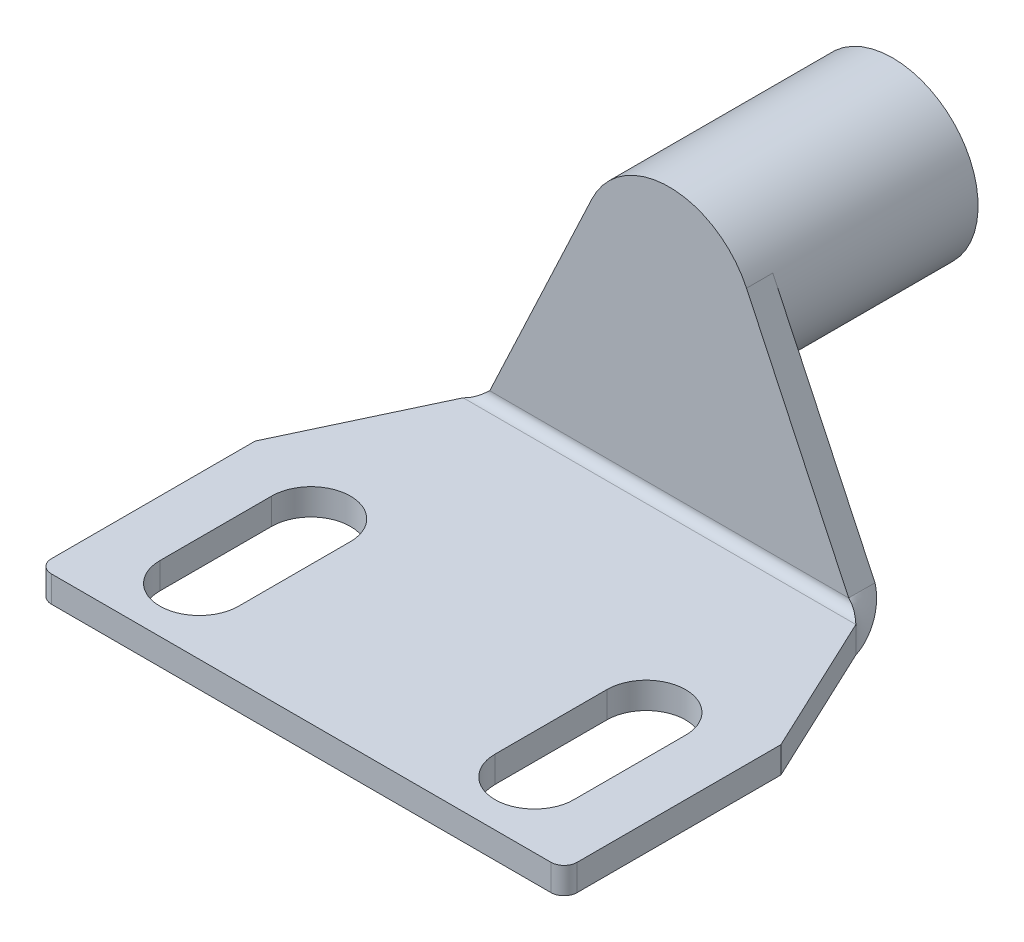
ISO-10303-21;
HEADER;
FILE_DESCRIPTION(('STEP AP214'),'2;1');
FILE_NAME('part.step','',(''),(''),'','','');
FILE_SCHEMA(('AUTOMOTIVE_DESIGN { 1 0 10303 214 1 1 1 1 }'));
ENDSEC;
DATA;
#1=APPLICATION_CONTEXT('core data for automotive mechanical design processes');
#2=APPLICATION_PROTOCOL_DEFINITION('international standard','automotive_design',2000,#1);
#3=PRODUCT_CONTEXT('',#1,'mechanical');
#4=PRODUCT('Part','Part','',(#3));
#5=PRODUCT_RELATED_PRODUCT_CATEGORY('part','',(#4));
#6=PRODUCT_DEFINITION_FORMATION('','',#4);
#7=PRODUCT_DEFINITION_CONTEXT('part definition',#1,'design');
#8=PRODUCT_DEFINITION('design','',#6,#7);
#9=PRODUCT_DEFINITION_SHAPE('','',#8);
#10=(LENGTH_UNIT() NAMED_UNIT(*) SI_UNIT(.MILLI.,.METRE.));
#11=(NAMED_UNIT(*) PLANE_ANGLE_UNIT() SI_UNIT($,.RADIAN.));
#12=(NAMED_UNIT(*) SI_UNIT($,.STERADIAN.) SOLID_ANGLE_UNIT());
#13=UNCERTAINTY_MEASURE_WITH_UNIT(LENGTH_MEASURE(1.E-05),#10,'distance_accuracy_value','');
#14=(GEOMETRIC_REPRESENTATION_CONTEXT(3) GLOBAL_UNCERTAINTY_ASSIGNED_CONTEXT((#13)) GLOBAL_UNIT_ASSIGNED_CONTEXT((#10,
#11,#12)) REPRESENTATION_CONTEXT('',''));
#15=CARTESIAN_POINT('',(0.,0.,0.));
#16=DIRECTION('',(0.,0.,1.));
#17=DIRECTION('',(1.,0.,0.));
#18=AXIS2_PLACEMENT_3D('',#15,#16,#17);
#19=CARTESIAN_POINT('',(-20.,-2.,0.));
#20=DIRECTION('',(-1.,0.,0.));
#21=DIRECTION('',(0.,0.,1.));
#22=AXIS2_PLACEMENT_3D('',#19,#20,#21);
#23=PLANE('',#22);
#24=DIRECTION('',(0.,0.,1.));
#25=VECTOR('',#24,1.);
#26=CARTESIAN_POINT('',(-20.,-2.,0.));
#27=LINE('',#26,#25);
#28=CARTESIAN_POINT('',(-20.,-2.,-18.5));
#29=VERTEX_POINT('',#28);
#30=CARTESIAN_POINT('',(-20.,-2.,-3.));
#31=VERTEX_POINT('',#30);
#32=EDGE_CURVE('E426',#29,#31,#27,.T.);
#33=ORIENTED_EDGE('',*,*,#32,.T.);
#34=DIRECTION('',(0.,1.,0.));
#35=VECTOR('',#34,1.);
#36=CARTESIAN_POINT('',(-20.,-2.,-3.));
#37=LINE('',#36,#35);
#38=CARTESIAN_POINT('',(-20.,0.,-3.));
#39=VERTEX_POINT('',#38);
#40=EDGE_CURVE('E552',#31,#39,#37,.T.);
#41=ORIENTED_EDGE('',*,*,#40,.T.);
#42=DIRECTION('',(0.,0.,1.));
#43=VECTOR('',#42,1.);
#44=CARTESIAN_POINT('',(-20.,0.,0.));
#45=LINE('',#44,#43);
#46=CARTESIAN_POINT('',(-20.,0.,-18.5));
#47=VERTEX_POINT('',#46);
#48=EDGE_CURVE('E416',#47,#39,#45,.T.);
#49=ORIENTED_EDGE('',*,*,#48,.F.);
#50=DIRECTION('',(0.,1.,0.));
#51=VECTOR('',#50,1.);
#52=CARTESIAN_POINT('',(-20.,-2.,-18.5));
#53=LINE('',#52,#51);
#54=EDGE_CURVE('E404',#29,#47,#53,.T.);
#55=ORIENTED_EDGE('',*,*,#54,.F.);
#56=EDGE_LOOP('',(#33,#41,#49,#55));
#57=FACE_BOUND('',#56,.T.);
#58=ADVANCED_FACE('F69',(#57),#23,.T.);
#59=CARTESIAN_POINT('',(20.,-2.,0.));
#60=DIRECTION('',(1.,0.,0.));
#61=DIRECTION('',(0.,0.,-1.));
#62=AXIS2_PLACEMENT_3D('',#59,#60,#61);
#63=PLANE('',#62);
#64=DIRECTION('',(0.,0.,-1.));
#65=VECTOR('',#64,1.);
#66=CARTESIAN_POINT('',(20.,0.,0.));
#67=LINE('',#66,#65);
#68=CARTESIAN_POINT('',(20.,0.,-3.));
#69=VERTEX_POINT('',#68);
#70=CARTESIAN_POINT('',(20.,0.,-18.5));
#71=VERTEX_POINT('',#70);
#72=EDGE_CURVE('E414',#69,#71,#67,.T.);
#73=ORIENTED_EDGE('',*,*,#72,.F.);
#74=DIRECTION('',(0.,-1.,0.));
#75=VECTOR('',#74,1.);
#76=CARTESIAN_POINT('',(20.,-2.,-3.));
#77=LINE('',#76,#75);
#78=CARTESIAN_POINT('',(20.,-2.,-3.));
#79=VERTEX_POINT('',#78);
#80=EDGE_CURVE('E12',#69,#79,#77,.T.);
#81=ORIENTED_EDGE('',*,*,#80,.T.);
#82=DIRECTION('',(0.,0.,-1.));
#83=VECTOR('',#82,1.);
#84=CARTESIAN_POINT('',(20.,-2.,0.));
#85=LINE('',#84,#83);
#86=CARTESIAN_POINT('',(20.,-2.,-18.5));
#87=VERTEX_POINT('',#86);
#88=EDGE_CURVE('E424',#79,#87,#85,.T.);
#89=ORIENTED_EDGE('',*,*,#88,.T.);
#90=DIRECTION('',(0.,1.,0.));
#91=VECTOR('',#90,1.);
#92=CARTESIAN_POINT('',(20.,-2.,-18.5));
#93=LINE('',#92,#91);
#94=EDGE_CURVE('E420',#87,#71,#93,.T.);
#95=ORIENTED_EDGE('',*,*,#94,.T.);
#96=EDGE_LOOP('',(#73,#81,#89,#95));
#97=FACE_BOUND('',#96,.T.);
#98=ADVANCED_FACE('F578',(#97),#63,.T.);
#99=CARTESIAN_POINT('',(0.,-2.,-45.75));
#100=DIRECTION('',(0.,1.,0.));
#101=DIRECTION('',(0.,0.,1.));
#102=AXIS2_PLACEMENT_3D('',#99,#100,#101);
#103=PLANE('',#102);
#104=DIRECTION('',(0.,0.,1.));
#105=VECTOR('',#104,1.);
#106=CARTESIAN_POINT('',(-15.75,-2.,-45.75));
#107=LINE('',#106,#105);
#108=CARTESIAN_POINT('',(-15.75,-2.,-15.5));
#109=VERTEX_POINT('',#108);
#110=CARTESIAN_POINT('',(-15.75,-2.,-7.));
#111=VERTEX_POINT('',#110);
#112=EDGE_CURVE('E268',#109,#111,#107,.T.);
#113=ORIENTED_EDGE('',*,*,#112,.T.);
#114=CARTESIAN_POINT('',(-12.75,-2.,-7.));
#115=DIRECTION('',(0.,1.,0.));
#116=DIRECTION('',(0.,0.,1.));
#117=AXIS2_PLACEMENT_3D('',#114,#115,#116);
#118=CIRCLE('',#117,3.);
#119=CARTESIAN_POINT('',(-9.75,-2.,-7.));
#120=VERTEX_POINT('',#119);
#121=EDGE_CURVE('E271',#111,#120,#118,.T.);
#122=ORIENTED_EDGE('',*,*,#121,.T.);
#123=DIRECTION('',(0.,0.,-1.));
#124=VECTOR('',#123,1.);
#125=CARTESIAN_POINT('',(-9.74999999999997,-2.,-45.75));
#126=LINE('',#125,#124);
#127=CARTESIAN_POINT('',(-9.74999999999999,-2.,-15.5));
#128=VERTEX_POINT('',#127);
#129=EDGE_CURVE('E239',#120,#128,#126,.T.);
#130=ORIENTED_EDGE('',*,*,#129,.T.);
#131=CARTESIAN_POINT('',(-12.75,-2.,-15.5));
#132=DIRECTION('',(0.,1.,0.));
#133=DIRECTION('',(0.,0.,1.));
#134=AXIS2_PLACEMENT_3D('',#131,#132,#133);
#135=CIRCLE('',#134,3.);
#136=EDGE_CURVE('E265',#128,#109,#135,.T.);
#137=ORIENTED_EDGE('',*,*,#136,.T.);
#138=EDGE_LOOP('',(#113,#122,#130,#137));
#139=FACE_BOUND('',#138,.T.);
#140=DIRECTION('',(0.,0.,1.));
#141=VECTOR('',#140,1.);
#142=CARTESIAN_POINT('',(9.74999999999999,-2.,-45.75));
#143=LINE('',#142,#141);
#144=CARTESIAN_POINT('',(9.75,-2.,-15.5));
#145=VERTEX_POINT('',#144);
#146=CARTESIAN_POINT('',(9.75,-2.,-7.));
#147=VERTEX_POINT('',#146);
#148=EDGE_CURVE('E277',#145,#147,#143,.T.);
#149=ORIENTED_EDGE('',*,*,#148,.T.);
#150=CARTESIAN_POINT('',(12.75,-2.,-7.));
#151=DIRECTION('',(0.,1.,0.));
#152=DIRECTION('',(0.,0.,1.));
#153=AXIS2_PLACEMENT_3D('',#150,#151,#152);
#154=CIRCLE('',#153,3.);
#155=CARTESIAN_POINT('',(15.75,-2.,-7.));
#156=VERTEX_POINT('',#155);
#157=EDGE_CURVE('E280',#147,#156,#154,.T.);
#158=ORIENTED_EDGE('',*,*,#157,.T.);
#159=DIRECTION('',(0.,0.,-1.));
#160=VECTOR('',#159,1.);
#161=CARTESIAN_POINT('',(15.75,-2.,-45.75));
#162=LINE('',#161,#160);
#163=CARTESIAN_POINT('',(15.75,-2.,-15.5));
#164=VERTEX_POINT('',#163);
#165=EDGE_CURVE('E274',#156,#164,#162,.T.);
#166=ORIENTED_EDGE('',*,*,#165,.T.);
#167=CARTESIAN_POINT('',(12.75,-2.,-15.5));
#168=DIRECTION('',(0.,1.,0.));
#169=DIRECTION('',(0.,0.,1.));
#170=AXIS2_PLACEMENT_3D('',#167,#168,#169);
#171=CIRCLE('',#170,3.);
#172=EDGE_CURVE('E214',#164,#145,#171,.T.);
#173=ORIENTED_EDGE('',*,*,#172,.T.);
#174=EDGE_LOOP('',(#149,#158,#166,#173));
#175=FACE_BOUND('',#174,.T.);
#176=DIRECTION('',(1.,0.,0.));
#177=VECTOR('',#176,1.);
#178=CARTESIAN_POINT('',(0.,-2.,-2.));
#179=LINE('',#178,#177);
#180=CARTESIAN_POINT('',(-19.,-2.,-2.));
#181=VERTEX_POINT('',#180);
#182=CARTESIAN_POINT('',(19.,-2.,-2.));
#183=VERTEX_POINT('',#182);
#184=EDGE_CURVE('E245',#181,#183,#179,.T.);
#185=ORIENTED_EDGE('',*,*,#184,.F.);
#186=CARTESIAN_POINT('',(-19.,-2.,-3.));
#187=DIRECTION('',(0.,1.,0.));
#188=DIRECTION('',(0.,0.,1.));
#189=AXIS2_PLACEMENT_3D('',#186,#187,#188);
#190=CIRCLE('',#189,1.);
#191=EDGE_CURVE('E77',#181,#31,#190,.F.);
#192=ORIENTED_EDGE('',*,*,#191,.T.);
#193=ORIENTED_EDGE('',*,*,#32,.F.);
#194=DIRECTION('',(-0.42561713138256,0.,0.904903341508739));
#195=VECTOR('',#194,1.);
#196=CARTESIAN_POINT('',(-20.,-2.,-18.5));
#197=LINE('',#196,#195);
#198=CARTESIAN_POINT('',(-14.9374842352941,-2.,-29.2634));
#199=VERTEX_POINT('',#198);
#200=EDGE_CURVE('E413',#199,#29,#197,.T.);
#201=ORIENTED_EDGE('',*,*,#200,.F.);
#202=DIRECTION('',(-1.,0.,0.));
#203=VECTOR('',#202,1.);
#204=CARTESIAN_POINT('',(0.,-2.,-29.2634));
#205=LINE('',#204,#203);
#206=CARTESIAN_POINT('',(14.9374842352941,-2.,-29.2634));
#207=VERTEX_POINT('',#206);
#208=EDGE_CURVE('E429',#207,#199,#205,.T.);
#209=ORIENTED_EDGE('',*,*,#208,.F.);
#210=DIRECTION('',(-0.42561713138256,0.,-0.904903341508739));
#211=VECTOR('',#210,1.);
#212=CARTESIAN_POINT('',(20.,-2.,-18.5));
#213=LINE('',#212,#211);
#214=EDGE_CURVE('E423',#87,#207,#213,.T.);
#215=ORIENTED_EDGE('',*,*,#214,.F.);
#216=ORIENTED_EDGE('',*,*,#88,.F.);
#217=CARTESIAN_POINT('',(19.,-2.,-3.));
#218=DIRECTION('',(0.,1.,0.));
#219=DIRECTION('',(0.,0.,1.));
#220=AXIS2_PLACEMENT_3D('',#217,#218,#219);
#221=CIRCLE('',#220,1.);
#222=EDGE_CURVE('E84',#79,#183,#221,.F.);
#223=ORIENTED_EDGE('',*,*,#222,.T.);
#224=EDGE_LOOP('',(#185,#192,#193,#201,#209,#215,#216,#223));
#225=FACE_BOUND('',#224,.T.);
#226=ADVANCED_FACE('F463',(#139,#175,#225),#103,.F.);
#227=CARTESIAN_POINT('',(0.,0.,-45.75));
#228=DIRECTION('',(0.,1.,0.));
#229=DIRECTION('',(0.,0.,1.));
#230=AXIS2_PLACEMENT_3D('',#227,#228,#229);
#231=PLANE('',#230);
#232=CARTESIAN_POINT('',(12.75,0.,-7.));
#233=DIRECTION('',(0.,1.,0.));
#234=DIRECTION('',(0.,0.,1.));
#235=AXIS2_PLACEMENT_3D('',#232,#233,#234);
#236=CIRCLE('',#235,3.);
#237=CARTESIAN_POINT('',(9.75,0.,-7.));
#238=VERTEX_POINT('',#237);
#239=CARTESIAN_POINT('',(15.75,0.,-7.));
#240=VERTEX_POINT('',#239);
#241=EDGE_CURVE('E227',#238,#240,#236,.T.);
#242=ORIENTED_EDGE('',*,*,#241,.F.);
#243=DIRECTION('',(0.,0.,1.));
#244=VECTOR('',#243,1.);
#245=CARTESIAN_POINT('',(9.75,0.,-7.));
#246=LINE('',#245,#244);
#247=CARTESIAN_POINT('',(9.75,0.,-15.5));
#248=VERTEX_POINT('',#247);
#249=EDGE_CURVE('E232',#248,#238,#246,.T.);
#250=ORIENTED_EDGE('',*,*,#249,.F.);
#251=CARTESIAN_POINT('',(12.75,0.,-15.5));
#252=DIRECTION('',(0.,1.,0.));
#253=DIRECTION('',(0.,0.,1.));
#254=AXIS2_PLACEMENT_3D('',#251,#252,#253);
#255=CIRCLE('',#254,3.);
#256=CARTESIAN_POINT('',(15.75,0.,-15.5));
#257=VERTEX_POINT('',#256);
#258=EDGE_CURVE('E211',#257,#248,#255,.T.);
#259=ORIENTED_EDGE('',*,*,#258,.F.);
#260=DIRECTION('',(0.,0.,-1.));
#261=VECTOR('',#260,1.);
#262=CARTESIAN_POINT('',(15.75,0.,-7.));
#263=LINE('',#262,#261);
#264=EDGE_CURVE('E222',#240,#257,#263,.T.);
#265=ORIENTED_EDGE('',*,*,#264,.F.);
#266=EDGE_LOOP('',(#242,#250,#259,#265));
#267=FACE_BOUND('',#266,.T.);
#268=CARTESIAN_POINT('',(-12.75,0.,-7.));
#269=DIRECTION('',(0.,1.,0.));
#270=DIRECTION('',(0.,0.,-1.));
#271=AXIS2_PLACEMENT_3D('',#268,#269,#270);
#272=CIRCLE('',#271,3.);
#273=CARTESIAN_POINT('',(-15.75,0.,-7.));
#274=VERTEX_POINT('',#273);
#275=CARTESIAN_POINT('',(-9.75,0.,-7.00000000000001));
#276=VERTEX_POINT('',#275);
#277=EDGE_CURVE('E242',#274,#276,#272,.T.);
#278=ORIENTED_EDGE('',*,*,#277,.F.);
#279=DIRECTION('',(0.,0.,1.));
#280=VECTOR('',#279,1.);
#281=CARTESIAN_POINT('',(-15.75,0.,-7.));
#282=LINE('',#281,#280);
#283=CARTESIAN_POINT('',(-15.75,0.,-15.5));
#284=VERTEX_POINT('',#283);
#285=EDGE_CURVE('E251',#284,#274,#282,.T.);
#286=ORIENTED_EDGE('',*,*,#285,.F.);
#287=CARTESIAN_POINT('',(-12.75,0.,-15.5));
#288=DIRECTION('',(0.,1.,0.));
#289=DIRECTION('',(0.,0.,-1.));
#290=AXIS2_PLACEMENT_3D('',#287,#288,#289);
#291=CIRCLE('',#290,3.);
#292=CARTESIAN_POINT('',(-9.74999999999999,0.,-15.5));
#293=VERTEX_POINT('',#292);
#294=EDGE_CURVE('E248',#293,#284,#291,.T.);
#295=ORIENTED_EDGE('',*,*,#294,.F.);
#296=DIRECTION('',(0.,0.,-1.));
#297=VECTOR('',#296,1.);
#298=CARTESIAN_POINT('',(-9.75,0.,-7.));
#299=LINE('',#298,#297);
#300=EDGE_CURVE('E244',#276,#293,#299,.T.);
#301=ORIENTED_EDGE('',*,*,#300,.F.);
#302=EDGE_LOOP('',(#278,#286,#295,#301));
#303=FACE_BOUND('',#302,.T.);
#304=ORIENTED_EDGE('',*,*,#48,.T.);
#305=CARTESIAN_POINT('',(-19.,0.,-3.));
#306=DIRECTION('',(0.,1.,0.));
#307=DIRECTION('',(0.,0.,1.));
#308=AXIS2_PLACEMENT_3D('',#305,#306,#307);
#309=CIRCLE('',#308,1.);
#310=CARTESIAN_POINT('',(-19.,0.,-2.));
#311=VERTEX_POINT('',#310);
#312=EDGE_CURVE('E557',#39,#311,#309,.T.);
#313=ORIENTED_EDGE('',*,*,#312,.T.);
#314=DIRECTION('',(1.,0.,0.));
#315=VECTOR('',#314,1.);
#316=CARTESIAN_POINT('',(0.,0.,-2.));
#317=LINE('',#316,#315);
#318=CARTESIAN_POINT('',(19.,0.,-2.));
#319=VERTEX_POINT('',#318);
#320=EDGE_CURVE('E290',#311,#319,#317,.T.);
#321=ORIENTED_EDGE('',*,*,#320,.T.);
#322=CARTESIAN_POINT('',(19.,0.,-3.));
#323=DIRECTION('',(0.,1.,0.));
#324=DIRECTION('',(0.,0.,1.));
#325=AXIS2_PLACEMENT_3D('',#322,#323,#324);
#326=CIRCLE('',#325,1.);
#327=EDGE_CURVE('E555',#319,#69,#326,.T.);
#328=ORIENTED_EDGE('',*,*,#327,.T.);
#329=ORIENTED_EDGE('',*,*,#72,.T.);
#330=DIRECTION('',(-0.42561713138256,0.,-0.904903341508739));
#331=VECTOR('',#330,1.);
#332=CARTESIAN_POINT('',(20.,0.,-18.5));
#333=LINE('',#332,#331);
#334=CARTESIAN_POINT('',(14.9374842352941,0.,-29.2634));
#335=VERTEX_POINT('',#334);
#336=EDGE_CURVE('E433',#71,#335,#333,.T.);
#337=ORIENTED_EDGE('',*,*,#336,.T.);
#338=DIRECTION('',(-1.,0.,0.));
#339=VECTOR('',#338,1.);
#340=CARTESIAN_POINT('',(0.,0.,-29.2634));
#341=LINE('',#340,#339);
#342=CARTESIAN_POINT('',(-14.9374842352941,0.,-29.2634));
#343=VERTEX_POINT('',#342);
#344=EDGE_CURVE('E430',#335,#343,#341,.T.);
#345=ORIENTED_EDGE('',*,*,#344,.T.);
#346=DIRECTION('',(-0.42561713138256,0.,0.904903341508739));
#347=VECTOR('',#346,1.);
#348=CARTESIAN_POINT('',(-20.,0.,-18.5));
#349=LINE('',#348,#347);
#350=EDGE_CURVE('E419',#343,#47,#349,.T.);
#351=ORIENTED_EDGE('',*,*,#350,.T.);
#352=EDGE_LOOP('',(#304,#313,#321,#328,#329,#337,#345,#351));
#353=FACE_BOUND('',#352,.T.);
#354=ADVANCED_FACE('F229',(#267,#303,#353),#231,.T.);
#355=CARTESIAN_POINT('',(0.,14.495355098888,-32.));
#356=DIRECTION('',(0.,0.,1.));
#357=DIRECTION('',(0.,-1.,0.));
#358=AXIS2_PLACEMENT_3D('',#355,#356,#357);
#359=PLANE('',#358);
#360=CARTESIAN_POINT('',(0.,14.495355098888,-32.));
#361=DIRECTION('',(0.,0.,-1.));
#362=DIRECTION('',(0.,1.,0.));
#363=AXIS2_PLACEMENT_3D('',#360,#361,#362);
#364=CIRCLE('',#363,6.5);
#365=CARTESIAN_POINT('',(5.88187171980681,17.2618664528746,-32.));
#366=VERTEX_POINT('',#365);
#367=CARTESIAN_POINT('',(-5.8818717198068,17.2618664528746,-32.));
#368=VERTEX_POINT('',#367);
#369=EDGE_CURVE('E286',#366,#368,#364,.T.);
#370=ORIENTED_EDGE('',*,*,#369,.F.);
#371=DIRECTION('',(-0.42561713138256,0.904903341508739,0.));
#372=VECTOR('',#371,1.);
#373=CARTESIAN_POINT('',(20.,-12.754644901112,-32.0000000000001));
#374=LINE('',#373,#372);
#375=CARTESIAN_POINT('',(13.6544549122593,0.736600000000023,-32.));
#376=VERTEX_POINT('',#375);
#377=EDGE_CURVE('E505',#376,#366,#374,.T.);
#378=ORIENTED_EDGE('',*,*,#377,.F.);
#379=DIRECTION('',(-1.,0.,0.));
#380=VECTOR('',#379,1.);
#381=CARTESIAN_POINT('',(0.,0.736600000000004,-32.));
#382=LINE('',#381,#380);
#383=CARTESIAN_POINT('',(-13.6544549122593,0.736600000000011,-32.));
#384=VERTEX_POINT('',#383);
#385=EDGE_CURVE('E493',#376,#384,#382,.T.);
#386=ORIENTED_EDGE('',*,*,#385,.T.);
#387=DIRECTION('',(-0.42561713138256,-0.904903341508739,0.));
#388=VECTOR('',#387,1.);
#389=CARTESIAN_POINT('',(-20.,-12.754644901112,-32.0000000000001));
#390=LINE('',#389,#388);
#391=EDGE_CURVE('E497',#368,#384,#390,.T.);
#392=ORIENTED_EDGE('',*,*,#391,.F.);
#393=EDGE_LOOP('',(#370,#378,#386,#392));
#394=FACE_BOUND('',#393,.T.);
#395=ADVANCED_FACE('F466',(#394),#359,.F.);
#396=CARTESIAN_POINT('',(-20.,-12.754644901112,-32.0000000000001));
#397=DIRECTION('',(-0.904903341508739,0.42561713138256,0.));
#398=DIRECTION('',(-0.42561713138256,-0.904903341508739,0.));
#399=AXIS2_PLACEMENT_3D('',#396,#397,#398);
#400=PLANE('',#399);
#401=CARTESIAN_POINT('',(-13.6544549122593,0.7366,-30.));
#402=CARTESIAN_POINT('',(-13.6544549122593,0.736599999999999,-32.));
#403=B_SPLINE_CURVE_WITH_KNOTS('',1,(#401,#402),.UNSPECIFIED.,.F.,.F.,(2,2),(0.,1.),.UNSPECIFIED.);
#404=CARTESIAN_POINT('',(-13.6544549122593,0.736600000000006,-30.));
#405=VERTEX_POINT('',#404);
#406=EDGE_CURVE('E291',#405,#384,#403,.T.);
#407=ORIENTED_EDGE('',*,*,#406,.F.);
#408=DIRECTION('',(-0.42561713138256,-0.904903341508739,0.));
#409=VECTOR('',#408,1.);
#410=CARTESIAN_POINT('',(-20.,-12.754644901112,-30.0000000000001));
#411=LINE('',#410,#409);
#412=CARTESIAN_POINT('',(-5.8818717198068,17.2618664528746,-30.));
#413=VERTEX_POINT('',#412);
#414=EDGE_CURVE('E490',#413,#405,#411,.T.);
#415=ORIENTED_EDGE('',*,*,#414,.F.);
#416=DIRECTION('',(0.,0.,1.));
#417=VECTOR('',#416,1.);
#418=CARTESIAN_POINT('',(-5.8818717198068,17.2618664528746,-32.));
#419=LINE('',#418,#417);
#420=EDGE_CURVE('E491',#368,#413,#419,.T.);
#421=ORIENTED_EDGE('',*,*,#420,.F.);
#422=ORIENTED_EDGE('',*,*,#391,.T.);
#423=EDGE_LOOP('',(#407,#415,#421,#422));
#424=FACE_BOUND('',#423,.T.);
#425=ADVANCED_FACE('F533',(#424),#400,.T.);
#426=CARTESIAN_POINT('',(0.,14.495355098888,-32.));
#427=DIRECTION('',(0.,0.,1.));
#428=DIRECTION('',(0.,-1.,0.));
#429=AXIS2_PLACEMENT_3D('',#426,#427,#428);
#430=CYLINDRICAL_SURFACE('',#429,6.50000000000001);
#431=CARTESIAN_POINT('',(0.,14.495355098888,-30.));
#432=DIRECTION('',(0.,0.,1.));
#433=DIRECTION('',(0.,-1.,0.));
#434=AXIS2_PLACEMENT_3D('',#431,#432,#433);
#435=CIRCLE('',#434,6.50000000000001);
#436=CARTESIAN_POINT('',(5.8818717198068,17.2618664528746,-30.));
#437=VERTEX_POINT('',#436);
#438=EDGE_CURVE('E487',#437,#413,#435,.T.);
#439=ORIENTED_EDGE('',*,*,#438,.F.);
#440=DIRECTION('',(0.,0.,1.));
#441=VECTOR('',#440,1.);
#442=CARTESIAN_POINT('',(5.8818717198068,17.2618664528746,-32.));
#443=LINE('',#442,#441);
#444=EDGE_CURVE('E494',#366,#437,#443,.T.);
#445=ORIENTED_EDGE('',*,*,#444,.F.);
#446=ORIENTED_EDGE('',*,*,#369,.T.);
#447=ORIENTED_EDGE('',*,*,#420,.T.);
#448=EDGE_LOOP('',(#439,#445,#446,#447));
#449=FACE_BOUND('',#448,.T.);
#450=CARTESIAN_POINT('',(0.,14.495355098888,-47.));
#451=DIRECTION('',(0.,0.,-1.));
#452=DIRECTION('',(0.,1.,0.));
#453=AXIS2_PLACEMENT_3D('',#450,#451,#452);
#454=CIRCLE('',#453,6.5);
#455=CARTESIAN_POINT('',(0.,20.995355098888,-46.9999999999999));
#456=VERTEX_POINT('',#455);
#457=EDGE_CURVE('E292',#456,#456,#454,.T.);
#458=ORIENTED_EDGE('',*,*,#457,.F.);
#459=EDGE_LOOP('',(#458));
#460=FACE_BOUND('',#459,.T.);
#461=ADVANCED_FACE('F471',(#449,#460),#430,.T.);
#462=CARTESIAN_POINT('',(20.,-12.754644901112,-32.0000000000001));
#463=DIRECTION('',(0.904903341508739,0.42561713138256,0.));
#464=DIRECTION('',(-0.42561713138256,0.904903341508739,0.));
#465=AXIS2_PLACEMENT_3D('',#462,#463,#464);
#466=PLANE('',#465);
#467=CARTESIAN_POINT('',(13.6544549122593,0.736599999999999,-32.));
#468=CARTESIAN_POINT('',(13.6544549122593,0.7366,-30.));
#469=B_SPLINE_CURVE_WITH_KNOTS('',1,(#467,#468),.UNSPECIFIED.,.F.,.F.,(2,2),(0.,1.),.UNSPECIFIED.);
#470=CARTESIAN_POINT('',(13.6544549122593,0.736600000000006,-30.));
#471=VERTEX_POINT('',#470);
#472=EDGE_CURVE('E500',#376,#471,#469,.T.);
#473=ORIENTED_EDGE('',*,*,#472,.F.);
#474=ORIENTED_EDGE('',*,*,#377,.T.);
#475=ORIENTED_EDGE('',*,*,#444,.T.);
#476=DIRECTION('',(-0.42561713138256,0.904903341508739,0.));
#477=VECTOR('',#476,1.);
#478=CARTESIAN_POINT('',(20.,-12.754644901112,-30.0000000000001));
#479=LINE('',#478,#477);
#480=EDGE_CURVE('E412',#471,#437,#479,.T.);
#481=ORIENTED_EDGE('',*,*,#480,.F.);
#482=EDGE_LOOP('',(#473,#474,#475,#481));
#483=FACE_BOUND('',#482,.T.);
#484=ADVANCED_FACE('F521',(#483),#466,.T.);
#485=CARTESIAN_POINT('',(0.,14.495355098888,-30.));
#486=DIRECTION('',(0.,0.,1.));
#487=DIRECTION('',(0.,-1.,0.));
#488=AXIS2_PLACEMENT_3D('',#485,#486,#487);
#489=PLANE('',#488);
#490=DIRECTION('',(-1.,0.,0.));
#491=VECTOR('',#490,1.);
#492=CARTESIAN_POINT('',(0.,0.736599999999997,-30.));
#493=LINE('',#492,#491);
#494=EDGE_CURVE('E583',#471,#405,#493,.T.);
#495=ORIENTED_EDGE('',*,*,#494,.F.);
#496=ORIENTED_EDGE('',*,*,#480,.T.);
#497=ORIENTED_EDGE('',*,*,#438,.T.);
#498=ORIENTED_EDGE('',*,*,#414,.T.);
#499=EDGE_LOOP('',(#495,#496,#497,#498));
#500=FACE_BOUND('',#499,.T.);
#501=ADVANCED_FACE('F462',(#500),#489,.T.);
#502=CARTESIAN_POINT('',(20.,-2.,-18.5));
#503=DIRECTION('',(0.904903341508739,0.,-0.42561713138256));
#504=DIRECTION('',(-0.42561713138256,0.,-0.904903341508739));
#505=AXIS2_PLACEMENT_3D('',#502,#503,#504);
#506=PLANE('',#505);
#507=ORIENTED_EDGE('',*,*,#214,.T.);
#508=CARTESIAN_POINT('',(14.9374842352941,0.,-29.2634));
#509=CARTESIAN_POINT('',(14.9374842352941,-2.,-29.2634));
#510=B_SPLINE_CURVE_WITH_KNOTS('',1,(#508,#509),.UNSPECIFIED.,.F.,.F.,(2,2),(0.,1.),.UNSPECIFIED.);
#511=EDGE_CURVE('E438',#207,#335,#510,.F.);
#512=ORIENTED_EDGE('',*,*,#511,.T.);
#513=ORIENTED_EDGE('',*,*,#336,.F.);
#514=ORIENTED_EDGE('',*,*,#94,.F.);
#515=EDGE_LOOP('',(#507,#512,#513,#514));
#516=FACE_BOUND('',#515,.T.);
#517=ADVANCED_FACE('F451',(#516),#506,.T.);
#518=CARTESIAN_POINT('',(-20.,-2.,-18.5));
#519=DIRECTION('',(-0.904903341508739,0.,-0.42561713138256));
#520=DIRECTION('',(-0.42561713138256,0.,0.904903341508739));
#521=AXIS2_PLACEMENT_3D('',#518,#519,#520);
#522=PLANE('',#521);
#523=ORIENTED_EDGE('',*,*,#350,.F.);
#524=CARTESIAN_POINT('',(-14.9374842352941,-2.,-29.2634));
#525=CARTESIAN_POINT('',(-14.9374842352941,0.,-29.2634));
#526=B_SPLINE_CURVE_WITH_KNOTS('',1,(#524,#525),.UNSPECIFIED.,.F.,.F.,(2,2),(0.,1.),.UNSPECIFIED.);
#527=EDGE_CURVE('E400',#343,#199,#526,.F.);
#528=ORIENTED_EDGE('',*,*,#527,.T.);
#529=ORIENTED_EDGE('',*,*,#200,.T.);
#530=ORIENTED_EDGE('',*,*,#54,.T.);
#531=EDGE_LOOP('',(#523,#528,#529,#530));
#532=FACE_BOUND('',#531,.T.);
#533=ADVANCED_FACE('F461',(#532),#522,.T.);
#534=CARTESIAN_POINT('',(13.6544549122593,0.736599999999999,-32.));
#535=CARTESIAN_POINT('',(13.7613917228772,0.378320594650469,-32.));
#536=CARTESIAN_POINT('',(13.8682931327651,0.0203007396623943,-31.9287736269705));
#537=CARTESIAN_POINT('',(14.0821313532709,-0.641603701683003,-31.6546038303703));
#538=CARTESIAN_POINT('',(14.1890504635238,-0.945168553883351,-31.4517682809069));
#539=CARTESIAN_POINT('',(14.4028886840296,-1.45176828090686,-30.9451685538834));
#540=CARTESIAN_POINT('',(14.5098077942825,-1.65460383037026,-30.641603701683));
#541=CARTESIAN_POINT('',(14.7236460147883,-1.92877362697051,-29.9796992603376));
#542=CARTESIAN_POINT('',(14.8305474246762,-2.,-29.6216794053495));
#543=CARTESIAN_POINT('',(14.9374842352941,-2.,-29.2634));
#544=CARTESIAN_POINT('',(13.6544549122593,0.7366,-30.));
#545=CARTESIAN_POINT('',(13.7613826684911,0.64017148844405,-30.));
#546=CARTESIAN_POINT('',(13.8682931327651,0.543796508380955,-29.9808282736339));
#547=CARTESIAN_POINT('',(14.0821313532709,0.365634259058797,-29.9070310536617));
#548=CARTESIAN_POINT('',(14.1890504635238,0.283924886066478,-29.8524345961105));
#549=CARTESIAN_POINT('',(14.4028886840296,0.147565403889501,-29.7160751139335));
#550=CARTESIAN_POINT('',(14.5098077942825,0.0929689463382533,-29.6343657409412));
#551=CARTESIAN_POINT('',(14.7236460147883,0.0191717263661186,-29.456203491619));
#552=CARTESIAN_POINT('',(14.8305564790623,0.,-29.3598285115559));
#553=CARTESIAN_POINT('',(14.9374842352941,0.,-29.2634));
#554=B_SPLINE_SURFACE_WITH_KNOTS('',1,3,((#534,#535,#536,#537,#538,#539,#540,#541,#542,#543),
(#544,#545,#546,#547,#548,#549,#550,#551,#552,#553)),.UNSPECIFIED.,.F.,.F.,.F.,(2,2),(4,2,2,2,
4),(0.,1.),(0.,0.25,0.5,0.75,1.),.UNSPECIFIED.);
#555=CARTESIAN_POINT('',(13.6544549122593,0.7366,-30.));
#556=CARTESIAN_POINT('',(13.7613826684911,0.64017148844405,-30.));
#557=CARTESIAN_POINT('',(13.8682931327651,0.543796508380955,-29.9808282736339));
#558=CARTESIAN_POINT('',(14.0821313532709,0.365634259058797,-29.9070310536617));
#559=CARTESIAN_POINT('',(14.1890504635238,0.283924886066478,-29.8524345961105));
#560=CARTESIAN_POINT('',(14.4028886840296,0.147565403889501,-29.7160751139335));
#561=CARTESIAN_POINT('',(14.5098077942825,0.0929689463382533,-29.6343657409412));
#562=CARTESIAN_POINT('',(14.7236460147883,0.0191717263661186,-29.456203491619));
#563=CARTESIAN_POINT('',(14.8305564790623,0.,-29.3598285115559));
#564=CARTESIAN_POINT('',(14.9374842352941,0.,-29.2634));
#565=B_SPLINE_CURVE_WITH_KNOTS('',3,(#555,#556,#557,#558,#559,#560,#561,#562,#563,#564),
.UNSPECIFIED.,.F.,.F.,(4,2,2,2,4),(0.,0.25,0.5,0.75,1.),.UNSPECIFIED.);
#566=EDGE_CURVE('E295',#471,#335,#565,.T.);
#567=CARTESIAN_POINT('',(14.9374842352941,-2.,-29.2634));
#568=CARTESIAN_POINT('',(14.8305474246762,-2.,-29.6216794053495));
#569=CARTESIAN_POINT('',(14.7236460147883,-1.92877362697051,-29.9796992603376));
#570=CARTESIAN_POINT('',(14.5098077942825,-1.65460383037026,-30.641603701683));
#571=CARTESIAN_POINT('',(14.4028886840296,-1.45176828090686,-30.9451685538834));
#572=CARTESIAN_POINT('',(14.1890504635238,-0.945168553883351,-31.4517682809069));
#573=CARTESIAN_POINT('',(14.0821313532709,-0.641603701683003,-31.6546038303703));
#574=CARTESIAN_POINT('',(13.8682931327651,0.0203007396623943,-31.9287736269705));
#575=CARTESIAN_POINT('',(13.7613917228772,0.378320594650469,-32.));
#576=CARTESIAN_POINT('',(13.6544549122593,0.736599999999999,-32.));
#577=B_SPLINE_CURVE_WITH_KNOTS('',3,(#567,#568,#569,#570,#571,#572,#573,#574,#575,#576),
.UNSPECIFIED.,.F.,.F.,(4,2,2,2,4),(0.,0.25,0.5,0.75,1.),.UNSPECIFIED.);
#578=EDGE_CURVE('E598',#376,#207,#577,.F.);
#579=ORIENTED_EDGE('',*,*,#472,.T.);
#580=ORIENTED_EDGE('',*,*,#566,.T.);
#581=ORIENTED_EDGE('',*,*,#511,.F.);
#582=ORIENTED_EDGE('',*,*,#578,.F.);
#583=EDGE_LOOP('',(#579,#580,#581,#582));
#584=FACE_BOUND('',#583,.T.);
#585=ADVANCED_FACE('F371',(#584),#554,.T.);
#586=CARTESIAN_POINT('',(-14.9374842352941,-2.,-29.2634));
#587=CARTESIAN_POINT('',(-14.8305474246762,-2.,-29.6216794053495));
#588=CARTESIAN_POINT('',(-14.7236460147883,-1.92877362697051,-29.9796992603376));
#589=CARTESIAN_POINT('',(-14.5098077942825,-1.65460383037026,-30.641603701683));
#590=CARTESIAN_POINT('',(-14.4028886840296,-1.45176828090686,-30.9451685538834));
#591=CARTESIAN_POINT('',(-14.1890504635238,-0.945168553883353,-31.4517682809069));
#592=CARTESIAN_POINT('',(-14.0821313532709,-0.641603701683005,-31.6546038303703));
#593=CARTESIAN_POINT('',(-13.8682931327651,0.020300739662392,-31.9287736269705));
#594=CARTESIAN_POINT('',(-13.7613917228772,0.378320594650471,-32.));
#595=CARTESIAN_POINT('',(-13.6544549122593,0.736599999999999,-32.));
#596=CARTESIAN_POINT('',(-14.9374842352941,0.,-29.2634));
#597=CARTESIAN_POINT('',(-14.8305564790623,0.,-29.3598285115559));
#598=CARTESIAN_POINT('',(-14.7236460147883,0.0191717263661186,-29.456203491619));
#599=CARTESIAN_POINT('',(-14.5098077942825,0.0929689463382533,-29.6343657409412));
#600=CARTESIAN_POINT('',(-14.4028886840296,0.1475654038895,-29.7160751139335));
#601=CARTESIAN_POINT('',(-14.1890504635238,0.283924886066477,-29.8524345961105));
#602=CARTESIAN_POINT('',(-14.0821313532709,0.365634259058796,-29.9070310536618));
#603=CARTESIAN_POINT('',(-13.8682931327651,0.543796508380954,-29.9808282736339));
#604=CARTESIAN_POINT('',(-13.7613826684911,0.640171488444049,-30.));
#605=CARTESIAN_POINT('',(-13.6544549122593,0.7366,-30.));
#606=B_SPLINE_SURFACE_WITH_KNOTS('',1,3,((#586,#587,#588,#589,#590,#591,#592,#593,#594,#595),
(#596,#597,#598,#599,#600,#601,#602,#603,#604,#605)),.UNSPECIFIED.,.F.,.F.,.F.,(2,2),(4,2,2,2,
4),(0.,1.),(0.,0.25,0.5,0.75,1.),.UNSPECIFIED.);
#607=CARTESIAN_POINT('',(-14.9374842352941,0.,-29.2634));
#608=CARTESIAN_POINT('',(-14.8305564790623,0.,-29.3598285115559));
#609=CARTESIAN_POINT('',(-14.7236460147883,0.0191717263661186,-29.456203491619));
#610=CARTESIAN_POINT('',(-14.5098077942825,0.0929689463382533,-29.6343657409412));
#611=CARTESIAN_POINT('',(-14.4028886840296,0.1475654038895,-29.7160751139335));
#612=CARTESIAN_POINT('',(-14.1890504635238,0.283924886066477,-29.8524345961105));
#613=CARTESIAN_POINT('',(-14.0821313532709,0.365634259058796,-29.9070310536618));
#614=CARTESIAN_POINT('',(-13.8682931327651,0.543796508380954,-29.9808282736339));
#615=CARTESIAN_POINT('',(-13.7613826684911,0.640171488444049,-30.));
#616=CARTESIAN_POINT('',(-13.6544549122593,0.7366,-30.));
#617=B_SPLINE_CURVE_WITH_KNOTS('',3,(#607,#608,#609,#610,#611,#612,#613,#614,#615,#616),
.UNSPECIFIED.,.F.,.F.,(4,2,2,2,4),(0.,0.25,0.5,0.75,1.),.UNSPECIFIED.);
#618=EDGE_CURVE('E343',#343,#405,#617,.T.);
#619=CARTESIAN_POINT('',(-13.6544549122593,0.736599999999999,-32.));
#620=CARTESIAN_POINT('',(-13.7613917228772,0.378320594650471,-32.));
#621=CARTESIAN_POINT('',(-13.8682931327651,0.020300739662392,-31.9287736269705));
#622=CARTESIAN_POINT('',(-14.0821313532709,-0.641603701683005,-31.6546038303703));
#623=CARTESIAN_POINT('',(-14.1890504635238,-0.945168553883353,-31.4517682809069));
#624=CARTESIAN_POINT('',(-14.4028886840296,-1.45176828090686,-30.9451685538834));
#625=CARTESIAN_POINT('',(-14.5098077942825,-1.65460383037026,-30.641603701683));
#626=CARTESIAN_POINT('',(-14.7236460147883,-1.92877362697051,-29.9796992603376));
#627=CARTESIAN_POINT('',(-14.8305474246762,-2.,-29.6216794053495));
#628=CARTESIAN_POINT('',(-14.9374842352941,-2.,-29.2634));
#629=B_SPLINE_CURVE_WITH_KNOTS('',3,(#619,#620,#621,#622,#623,#624,#625,#626,#627,#628),
.UNSPECIFIED.,.F.,.F.,(4,2,2,2,4),(0.,0.25,0.5,0.75,1.),.UNSPECIFIED.);
#630=EDGE_CURVE('E336',#199,#384,#629,.F.);
#631=ORIENTED_EDGE('',*,*,#618,.T.);
#632=ORIENTED_EDGE('',*,*,#406,.T.);
#633=ORIENTED_EDGE('',*,*,#630,.F.);
#634=ORIENTED_EDGE('',*,*,#527,.F.);
#635=EDGE_LOOP('',(#631,#632,#633,#634));
#636=FACE_BOUND('',#635,.T.);
#637=ADVANCED_FACE('F314',(#636),#606,.T.);
#638=CARTESIAN_POINT('',(-30.0658423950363,0.7366,-29.2634));
#639=DIRECTION('',(1.,0.,0.));
#640=DIRECTION('',(0.,0.,-1.));
#641=AXIS2_PLACEMENT_3D('',#638,#639,#640);
#642=CYLINDRICAL_SURFACE('',#641,2.7366);
#643=ORIENTED_EDGE('',*,*,#208,.T.);
#644=ORIENTED_EDGE('',*,*,#630,.T.);
#645=ORIENTED_EDGE('',*,*,#385,.F.);
#646=ORIENTED_EDGE('',*,*,#578,.T.);
#647=EDGE_LOOP('',(#643,#644,#645,#646));
#648=FACE_BOUND('',#647,.T.);
#649=ADVANCED_FACE('F303',(#648),#642,.T.);
#650=CARTESIAN_POINT('',(-30.0658423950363,0.7366,-29.2634));
#651=DIRECTION('',(1.,0.,0.));
#652=DIRECTION('',(0.,0.,-1.));
#653=AXIS2_PLACEMENT_3D('',#650,#651,#652);
#654=CYLINDRICAL_SURFACE('',#653,0.7366);
#655=ORIENTED_EDGE('',*,*,#344,.F.);
#656=ORIENTED_EDGE('',*,*,#566,.F.);
#657=ORIENTED_EDGE('',*,*,#494,.T.);
#658=ORIENTED_EDGE('',*,*,#618,.F.);
#659=EDGE_LOOP('',(#655,#656,#657,#658));
#660=FACE_BOUND('',#659,.T.);
#661=ADVANCED_FACE('F313',(#660),#654,.F.);
#662=CARTESIAN_POINT('',(0.,14.495355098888,-47.));
#663=DIRECTION('',(0.,0.,-1.));
#664=DIRECTION('',(0.,1.,0.));
#665=AXIS2_PLACEMENT_3D('',#662,#663,#664);
#666=PLANE('',#665);
#667=CARTESIAN_POINT('',(0.,14.495355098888,-47.));
#668=DIRECTION('',(0.,0.,-1.));
#669=DIRECTION('',(0.,1.,0.));
#670=AXIS2_PLACEMENT_3D('',#667,#668,#669);
#671=CIRCLE('',#670,5.);
#672=CARTESIAN_POINT('',(0.,19.495355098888,-46.9999999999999));
#673=VERTEX_POINT('',#672);
#674=EDGE_CURVE('E287',#673,#673,#671,.T.);
#675=ORIENTED_EDGE('',*,*,#674,.F.);
#676=EDGE_LOOP('',(#675));
#677=FACE_BOUND('',#676,.T.);
#678=ORIENTED_EDGE('',*,*,#457,.T.);
#679=EDGE_LOOP('',(#678));
#680=FACE_BOUND('',#679,.T.);
#681=ADVANCED_FACE('F316',(#677,#680),#666,.T.);
#682=CARTESIAN_POINT('',(0.,14.495355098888,-47.15));
#683=DIRECTION('',(0.,0.,1.));
#684=DIRECTION('',(0.,-1.,0.));
#685=AXIS2_PLACEMENT_3D('',#682,#683,#684);
#686=CYLINDRICAL_SURFACE('',#685,5.);
#687=CARTESIAN_POINT('',(0.,14.495355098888,-47.15));
#688=DIRECTION('',(0.,0.,-1.));
#689=DIRECTION('',(0.,1.,0.));
#690=AXIS2_PLACEMENT_3D('',#687,#688,#689);
#691=CIRCLE('',#690,5.);
#692=CARTESIAN_POINT('',(0.,19.495355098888,-47.1499999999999));
#693=VERTEX_POINT('',#692);
#694=EDGE_CURVE('E283',#693,#693,#691,.T.);
#695=ORIENTED_EDGE('',*,*,#694,.F.);
#696=EDGE_LOOP('',(#695));
#697=FACE_BOUND('',#696,.T.);
#698=ORIENTED_EDGE('',*,*,#674,.T.);
#699=EDGE_LOOP('',(#698));
#700=FACE_BOUND('',#699,.T.);
#701=ADVANCED_FACE('F636',(#697,#700),#686,.T.);
#702=CARTESIAN_POINT('',(0.,14.495355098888,-47.15));
#703=DIRECTION('',(0.,0.,-1.));
#704=DIRECTION('',(0.,1.,0.));
#705=AXIS2_PLACEMENT_3D('',#702,#703,#704);
#706=PLANE('',#705);
#707=ORIENTED_EDGE('',*,*,#694,.T.);
#708=EDGE_LOOP('',(#707));
#709=FACE_BOUND('',#708,.T.);
#710=ADVANCED_FACE('F642',(#709),#706,.T.);
#711=CARTESIAN_POINT('',(-12.75,-2.005025,-7.));
#712=DIRECTION('',(0.,1.,0.));
#713=DIRECTION('',(0.,0.,1.));
#714=AXIS2_PLACEMENT_3D('',#711,#712,#713);
#715=CYLINDRICAL_SURFACE('',#714,3.);
#716=DIRECTION('',(0.,1.,0.));
#717=VECTOR('',#716,1.);
#718=CARTESIAN_POINT('',(-15.75,-2.005025,-7.));
#719=LINE('',#718,#717);
#720=EDGE_CURVE('E255',#111,#274,#719,.T.);
#721=ORIENTED_EDGE('',*,*,#720,.T.);
#722=ORIENTED_EDGE('',*,*,#277,.T.);
#723=DIRECTION('',(0.,1.,0.));
#724=VECTOR('',#723,1.);
#725=CARTESIAN_POINT('',(-9.75,-2.005025,-7.));
#726=LINE('',#725,#724);
#727=EDGE_CURVE('E254',#120,#276,#726,.T.);
#728=ORIENTED_EDGE('',*,*,#727,.F.);
#729=ORIENTED_EDGE('',*,*,#121,.F.);
#730=EDGE_LOOP('',(#721,#722,#728,#729));
#731=FACE_BOUND('',#730,.T.);
#732=ADVANCED_FACE('F679',(#731),#715,.F.);
#733=CARTESIAN_POINT('',(-15.75,-2.005025,-7.));
#734=DIRECTION('',(-1.,0.,0.));
#735=DIRECTION('',(0.,0.,1.));
#736=AXIS2_PLACEMENT_3D('',#733,#734,#735);
#737=PLANE('',#736);
#738=DIRECTION('',(0.,1.,0.));
#739=VECTOR('',#738,1.);
#740=CARTESIAN_POINT('',(-15.75,-2.005025,-15.5));
#741=LINE('',#740,#739);
#742=EDGE_CURVE('E257',#109,#284,#741,.T.);
#743=ORIENTED_EDGE('',*,*,#742,.T.);
#744=ORIENTED_EDGE('',*,*,#285,.T.);
#745=ORIENTED_EDGE('',*,*,#720,.F.);
#746=ORIENTED_EDGE('',*,*,#112,.F.);
#747=EDGE_LOOP('',(#743,#744,#745,#746));
#748=FACE_BOUND('',#747,.T.);
#749=ADVANCED_FACE('F676',(#748),#737,.F.);
#750=CARTESIAN_POINT('',(-12.75,-2.005025,-15.5));
#751=DIRECTION('',(0.,1.,0.));
#752=DIRECTION('',(0.,0.,1.));
#753=AXIS2_PLACEMENT_3D('',#750,#751,#752);
#754=CYLINDRICAL_SURFACE('',#753,3.);
#755=DIRECTION('',(0.,1.,0.));
#756=VECTOR('',#755,1.);
#757=CARTESIAN_POINT('',(-9.74999999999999,-2.005025,-15.5));
#758=LINE('',#757,#756);
#759=EDGE_CURVE('E259',#128,#293,#758,.T.);
#760=ORIENTED_EDGE('',*,*,#759,.T.);
#761=ORIENTED_EDGE('',*,*,#294,.T.);
#762=ORIENTED_EDGE('',*,*,#742,.F.);
#763=ORIENTED_EDGE('',*,*,#136,.F.);
#764=EDGE_LOOP('',(#760,#761,#762,#763));
#765=FACE_BOUND('',#764,.T.);
#766=ADVANCED_FACE('F670',(#765),#754,.F.);
#767=CARTESIAN_POINT('',(-9.75,-2.005025,-7.));
#768=DIRECTION('',(1.,0.,0.));
#769=DIRECTION('',(0.,0.,-1.));
#770=AXIS2_PLACEMENT_3D('',#767,#768,#769);
#771=PLANE('',#770);
#772=ORIENTED_EDGE('',*,*,#727,.T.);
#773=ORIENTED_EDGE('',*,*,#300,.T.);
#774=ORIENTED_EDGE('',*,*,#759,.F.);
#775=ORIENTED_EDGE('',*,*,#129,.F.);
#776=EDGE_LOOP('',(#772,#773,#774,#775));
#777=FACE_BOUND('',#776,.T.);
#778=ADVANCED_FACE('F663',(#777),#771,.F.);
#779=CARTESIAN_POINT('',(12.75,-2.005025,-7.));
#780=DIRECTION('',(0.,1.,0.));
#781=DIRECTION('',(0.,0.,1.));
#782=AXIS2_PLACEMENT_3D('',#779,#780,#781);
#783=CYLINDRICAL_SURFACE('',#782,3.);
#784=DIRECTION('',(0.,1.,0.));
#785=VECTOR('',#784,1.);
#786=CARTESIAN_POINT('',(9.75,-2.005025,-7.));
#787=LINE('',#786,#785);
#788=EDGE_CURVE('E237',#147,#238,#787,.T.);
#789=ORIENTED_EDGE('',*,*,#788,.T.);
#790=ORIENTED_EDGE('',*,*,#241,.T.);
#791=DIRECTION('',(0.,1.,0.));
#792=VECTOR('',#791,1.);
#793=CARTESIAN_POINT('',(15.75,-2.005025,-7.));
#794=LINE('',#793,#792);
#795=EDGE_CURVE('E218',#156,#240,#794,.T.);
#796=ORIENTED_EDGE('',*,*,#795,.F.);
#797=ORIENTED_EDGE('',*,*,#157,.F.);
#798=EDGE_LOOP('',(#789,#790,#796,#797));
#799=FACE_BOUND('',#798,.T.);
#800=ADVANCED_FACE('F660',(#799),#783,.F.);
#801=CARTESIAN_POINT('',(9.75,-2.005025,-7.));
#802=DIRECTION('',(-1.,0.,0.));
#803=DIRECTION('',(0.,0.,1.));
#804=AXIS2_PLACEMENT_3D('',#801,#802,#803);
#805=PLANE('',#804);
#806=DIRECTION('',(0.,1.,0.));
#807=VECTOR('',#806,1.);
#808=CARTESIAN_POINT('',(9.75,-2.005025,-15.5));
#809=LINE('',#808,#807);
#810=EDGE_CURVE('E217',#145,#248,#809,.T.);
#811=ORIENTED_EDGE('',*,*,#810,.T.);
#812=ORIENTED_EDGE('',*,*,#249,.T.);
#813=ORIENTED_EDGE('',*,*,#788,.F.);
#814=ORIENTED_EDGE('',*,*,#148,.F.);
#815=EDGE_LOOP('',(#811,#812,#813,#814));
#816=FACE_BOUND('',#815,.T.);
#817=ADVANCED_FACE('F658',(#816),#805,.F.);
#818=CARTESIAN_POINT('',(12.75,-2.005025,-15.5));
#819=DIRECTION('',(0.,1.,0.));
#820=DIRECTION('',(0.,0.,1.));
#821=AXIS2_PLACEMENT_3D('',#818,#819,#820);
#822=CYLINDRICAL_SURFACE('',#821,3.);
#823=DIRECTION('',(0.,1.,0.));
#824=VECTOR('',#823,1.);
#825=CARTESIAN_POINT('',(15.75,-2.005025,-15.5));
#826=LINE('',#825,#824);
#827=EDGE_CURVE('E206',#164,#257,#826,.T.);
#828=ORIENTED_EDGE('',*,*,#827,.T.);
#829=ORIENTED_EDGE('',*,*,#258,.T.);
#830=ORIENTED_EDGE('',*,*,#810,.F.);
#831=ORIENTED_EDGE('',*,*,#172,.F.);
#832=EDGE_LOOP('',(#828,#829,#830,#831));
#833=FACE_BOUND('',#832,.T.);
#834=ADVANCED_FACE('F208',(#833),#822,.F.);
#835=CARTESIAN_POINT('',(15.75,-2.005025,-7.));
#836=DIRECTION('',(1.,0.,0.));
#837=DIRECTION('',(0.,0.,-1.));
#838=AXIS2_PLACEMENT_3D('',#835,#836,#837);
#839=PLANE('',#838);
#840=ORIENTED_EDGE('',*,*,#795,.T.);
#841=ORIENTED_EDGE('',*,*,#264,.T.);
#842=ORIENTED_EDGE('',*,*,#827,.F.);
#843=ORIENTED_EDGE('',*,*,#165,.F.);
#844=EDGE_LOOP('',(#840,#841,#842,#843));
#845=FACE_BOUND('',#844,.T.);
#846=ADVANCED_FACE('F223',(#845),#839,.F.);
#847=CARTESIAN_POINT('',(0.,0.,-2.));
#848=DIRECTION('',(0.,0.,1.));
#849=DIRECTION('',(1.,0.,0.));
#850=AXIS2_PLACEMENT_3D('',#847,#848,#849);
#851=PLANE('',#850);
#852=ORIENTED_EDGE('',*,*,#320,.F.);
#853=DIRECTION('',(0.,1.,0.));
#854=VECTOR('',#853,1.);
#855=CARTESIAN_POINT('',(-19.,0.,-2.));
#856=LINE('',#855,#854);
#857=EDGE_CURVE('E561',#311,#181,#856,.F.);
#858=ORIENTED_EDGE('',*,*,#857,.T.);
#859=ORIENTED_EDGE('',*,*,#184,.T.);
#860=DIRECTION('',(0.,-1.,0.));
#861=VECTOR('',#860,1.);
#862=CARTESIAN_POINT('',(19.,0.,-2.));
#863=LINE('',#862,#861);
#864=EDGE_CURVE('E559',#183,#319,#863,.F.);
#865=ORIENTED_EDGE('',*,*,#864,.T.);
#866=EDGE_LOOP('',(#852,#858,#859,#865));
#867=FACE_BOUND('',#866,.T.);
#868=ADVANCED_FACE('F575',(#867),#851,.T.);
#869=CARTESIAN_POINT('',(-19.,-2.,-3.));
#870=DIRECTION('',(0.,1.,0.));
#871=DIRECTION('',(0.,0.,1.));
#872=AXIS2_PLACEMENT_3D('',#869,#870,#871);
#873=CYLINDRICAL_SURFACE('',#872,1.);
#874=ORIENTED_EDGE('',*,*,#191,.F.);
#875=ORIENTED_EDGE('',*,*,#857,.F.);
#876=ORIENTED_EDGE('',*,*,#312,.F.);
#877=ORIENTED_EDGE('',*,*,#40,.F.);
#878=EDGE_LOOP('',(#874,#875,#876,#877));
#879=FACE_BOUND('',#878,.T.);
#880=ADVANCED_FACE('F537',(#879),#873,.T.);
#881=CARTESIAN_POINT('',(19.,-2.,-3.));
#882=DIRECTION('',(0.,-1.,0.));
#883=DIRECTION('',(0.,0.,-1.));
#884=AXIS2_PLACEMENT_3D('',#881,#882,#883);
#885=CYLINDRICAL_SURFACE('',#884,1.);
#886=ORIENTED_EDGE('',*,*,#327,.F.);
#887=ORIENTED_EDGE('',*,*,#864,.F.);
#888=ORIENTED_EDGE('',*,*,#222,.F.);
#889=ORIENTED_EDGE('',*,*,#80,.F.);
#890=EDGE_LOOP('',(#886,#887,#888,#889));
#891=FACE_BOUND('',#890,.T.);
#892=ADVANCED_FACE('F71',(#891),#885,.T.);
#893=CLOSED_SHELL('',(#58,#98,#226,#354,#395,#425,#461,#484,#501,#517,#533,#585,#637,#649,#661,
#681,#701,#710,#732,#749,#766,#778,#800,#817,#834,#846,#868,#880,#892));
#894=MANIFOLD_SOLID_BREP('B2',#893);
#895=ADVANCED_BREP_SHAPE_REPRESENTATION('',(#18,#894),#14);
#896=SHAPE_DEFINITION_REPRESENTATION(#9,#895);
ENDSEC;
END-ISO-10303-21;
